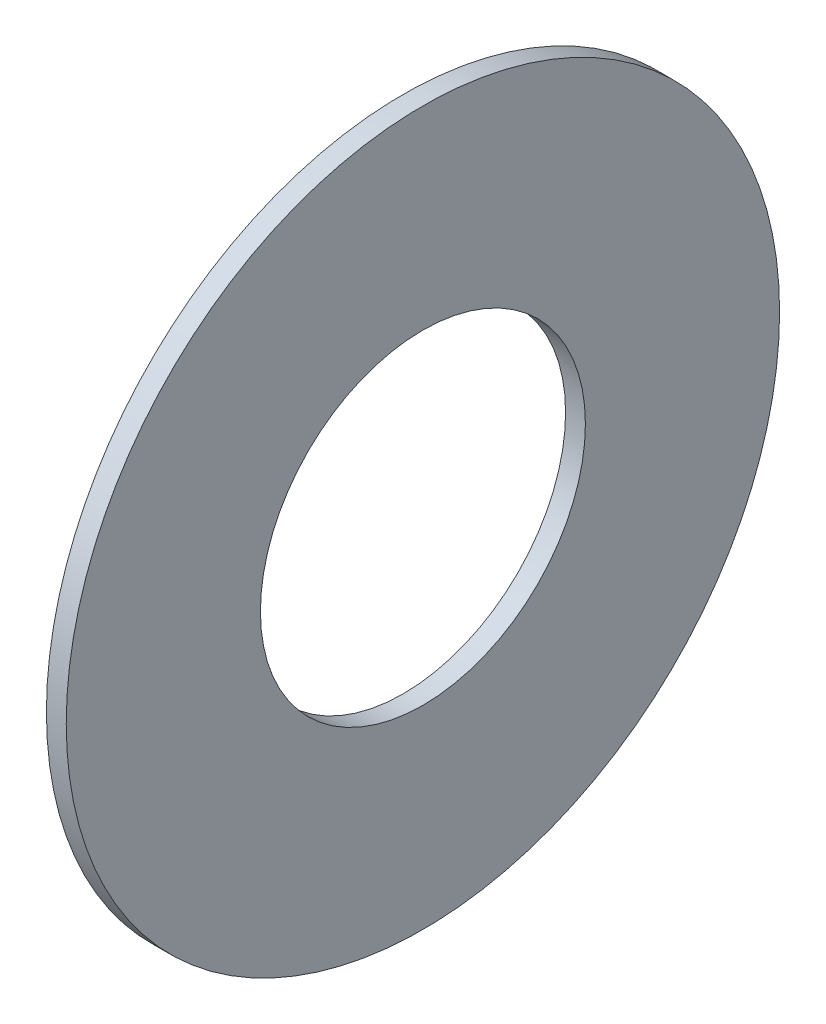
ISO-10303-21;
HEADER;
FILE_DESCRIPTION(('STEP AP214'),'2;1');
FILE_NAME('part.step','',(''),(''),'','','');
FILE_SCHEMA(('AUTOMOTIVE_DESIGN { 1 0 10303 214 1 1 1 1 }'));
ENDSEC;
DATA;
#1=APPLICATION_CONTEXT('core data for automotive mechanical design processes');
#2=APPLICATION_PROTOCOL_DEFINITION('international standard','automotive_design',2000,#1);
#3=PRODUCT_CONTEXT('',#1,'mechanical');
#4=PRODUCT('Part','Part','',(#3));
#5=PRODUCT_RELATED_PRODUCT_CATEGORY('part','',(#4));
#6=PRODUCT_DEFINITION_FORMATION('','',#4);
#7=PRODUCT_DEFINITION_CONTEXT('part definition',#1,'design');
#8=PRODUCT_DEFINITION('design','',#6,#7);
#9=PRODUCT_DEFINITION_SHAPE('','',#8);
#10=(LENGTH_UNIT() NAMED_UNIT(*) SI_UNIT(.MILLI.,.METRE.));
#11=(NAMED_UNIT(*) PLANE_ANGLE_UNIT() SI_UNIT($,.RADIAN.));
#12=(NAMED_UNIT(*) SI_UNIT($,.STERADIAN.) SOLID_ANGLE_UNIT());
#13=UNCERTAINTY_MEASURE_WITH_UNIT(LENGTH_MEASURE(1.E-05),#10,'distance_accuracy_value','');
#14=(GEOMETRIC_REPRESENTATION_CONTEXT(3) GLOBAL_UNCERTAINTY_ASSIGNED_CONTEXT((#13)) GLOBAL_UNIT_ASSIGNED_CONTEXT((#10,
#11,#12)) REPRESENTATION_CONTEXT('',''));
#15=CARTESIAN_POINT('',(0.,0.,0.));
#16=DIRECTION('',(0.,0.,1.));
#17=DIRECTION('',(1.,0.,0.));
#18=AXIS2_PLACEMENT_3D('',#15,#16,#17);
#19=CARTESIAN_POINT('',(0.,0.,0.));
#20=DIRECTION('',(1.,0.,0.));
#21=DIRECTION('',(0.,0.,-1.));
#22=AXIS2_PLACEMENT_3D('',#19,#20,#21);
#23=CYLINDRICAL_SURFACE('',#22,4.1);
#24=CARTESIAN_POINT('',(0.5,0.,0.));
#25=DIRECTION('',(1.,0.,0.));
#26=DIRECTION('',(0.,0.,-1.));
#27=AXIS2_PLACEMENT_3D('',#24,#25,#26);
#28=CIRCLE('',#27,4.1);
#29=CARTESIAN_POINT('',(0.5,0.,-4.1));
#30=VERTEX_POINT('',#29);
#31=EDGE_CURVE('E10',#30,#30,#28,.T.);
#32=ORIENTED_EDGE('',*,*,#31,.T.);
#33=EDGE_LOOP('',(#32));
#34=FACE_BOUND('',#33,.T.);
#35=CARTESIAN_POINT('',(0.,0.,0.));
#36=DIRECTION('',(1.,0.,0.));
#37=DIRECTION('',(0.,0.,-1.));
#38=AXIS2_PLACEMENT_3D('',#35,#36,#37);
#39=CIRCLE('',#38,4.1);
#40=CARTESIAN_POINT('',(0.,0.,-4.1));
#41=VERTEX_POINT('',#40);
#42=EDGE_CURVE('E47',#41,#41,#39,.T.);
#43=ORIENTED_EDGE('',*,*,#42,.F.);
#44=EDGE_LOOP('',(#43));
#45=FACE_BOUND('',#44,.T.);
#46=ADVANCED_FACE('F33',(#34,#45),#23,.F.);
#47=CARTESIAN_POINT('',(0.5,4.1,0.));
#48=DIRECTION('',(1.,0.,0.));
#49=DIRECTION('',(0.,0.,-1.));
#50=AXIS2_PLACEMENT_3D('',#47,#48,#49);
#51=PLANE('',#50);
#52=CARTESIAN_POINT('',(0.5,0.,0.));
#53=DIRECTION('',(1.,0.,0.));
#54=DIRECTION('',(0.,0.,-1.));
#55=AXIS2_PLACEMENT_3D('',#52,#53,#54);
#56=CIRCLE('',#55,9.);
#57=CARTESIAN_POINT('',(0.5,0.,-9.));
#58=VERTEX_POINT('',#57);
#59=EDGE_CURVE('E39',#58,#58,#56,.T.);
#60=ORIENTED_EDGE('',*,*,#59,.T.);
#61=EDGE_LOOP('',(#60));
#62=FACE_BOUND('',#61,.T.);
#63=ORIENTED_EDGE('',*,*,#31,.F.);
#64=EDGE_LOOP('',(#63));
#65=FACE_BOUND('',#64,.T.);
#66=ADVANCED_FACE('F57',(#62,#65),#51,.T.);
#67=CARTESIAN_POINT('',(0.,0.,0.));
#68=DIRECTION('',(1.,0.,0.));
#69=DIRECTION('',(0.,0.,-1.));
#70=AXIS2_PLACEMENT_3D('',#67,#68,#69);
#71=CYLINDRICAL_SURFACE('',#70,9.);
#72=CARTESIAN_POINT('',(0.,0.,0.));
#73=DIRECTION('',(1.,0.,0.));
#74=DIRECTION('',(0.,0.,-1.));
#75=AXIS2_PLACEMENT_3D('',#72,#73,#74);
#76=CIRCLE('',#75,9.);
#77=CARTESIAN_POINT('',(0.,0.,-9.));
#78=VERTEX_POINT('',#77);
#79=EDGE_CURVE('E43',#78,#78,#76,.T.);
#80=ORIENTED_EDGE('',*,*,#79,.T.);
#81=EDGE_LOOP('',(#80));
#82=FACE_BOUND('',#81,.T.);
#83=ORIENTED_EDGE('',*,*,#59,.F.);
#84=EDGE_LOOP('',(#83));
#85=FACE_BOUND('',#84,.T.);
#86=ADVANCED_FACE('F61',(#82,#85),#71,.T.);
#87=CARTESIAN_POINT('',(0.,9.,0.));
#88=DIRECTION('',(-1.,0.,0.));
#89=DIRECTION('',(0.,0.,1.));
#90=AXIS2_PLACEMENT_3D('',#87,#88,#89);
#91=PLANE('',#90);
#92=ORIENTED_EDGE('',*,*,#42,.T.);
#93=EDGE_LOOP('',(#92));
#94=FACE_BOUND('',#93,.T.);
#95=ORIENTED_EDGE('',*,*,#79,.F.);
#96=EDGE_LOOP('',(#95));
#97=FACE_BOUND('',#96,.T.);
#98=ADVANCED_FACE('F53',(#94,#97),#91,.T.);
#99=CLOSED_SHELL('',(#46,#66,#86,#98));
#100=MANIFOLD_SOLID_BREP('B2',#99);
#101=ADVANCED_BREP_SHAPE_REPRESENTATION('',(#18,#100),#14);
#102=SHAPE_DEFINITION_REPRESENTATION(#9,#101);
ENDSEC;
END-ISO-10303-21;
